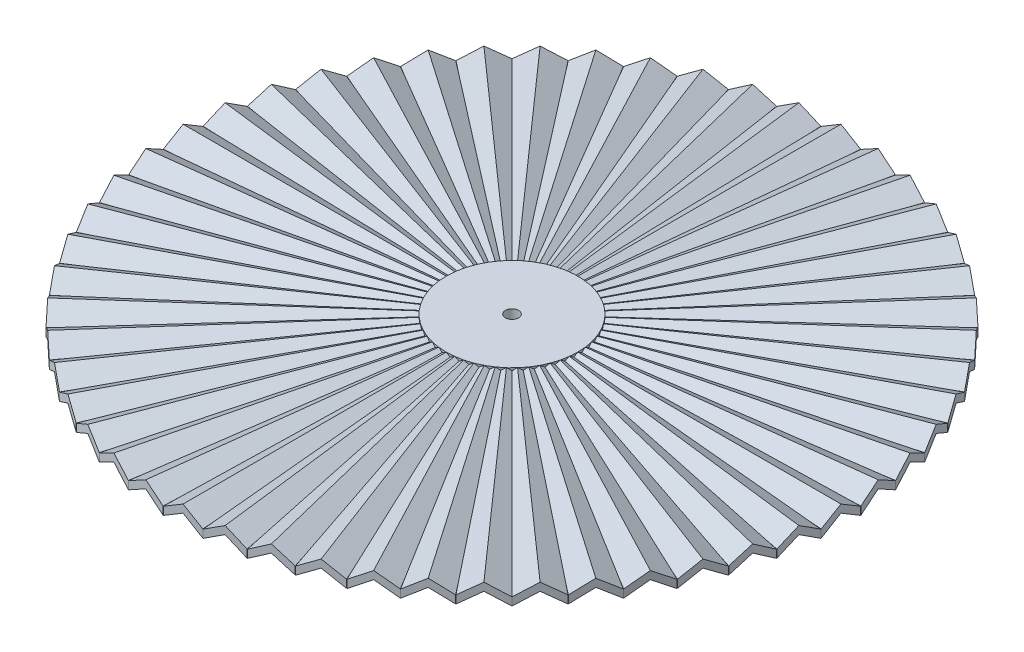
from build123d import *

# Parameters (mm, degrees)
SALIENTE_EXTRUIR1_DEPTH      = 200
CORTAR_EXTRUIR1_DEPTH        = 200
MATRIZC1_COUNT               = 52
SALIENTE_EXTRUIR2_DEPTH      = 6
SALIENTE_EXTRUIR2_DEPTH_BACK = 3
CROQUIS6_R                   = 50
CROQUIS7_R                   = 5
CORTAR_EXTRUIR2_DEPTH        = 40


with BuildPart() as part:
    # Croquis1 → Saliente-Extruir1 (new body)
    with BuildSketch(Plane.XY.offset(250)):
        Polygon((0, 6), (-15, -2.938354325), (-15, -9), (0, 0), (15, -9), (15, -2.938354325), align=None)
    extrude(amount=-SALIENTE_EXTRUIR1_DEPTH)

    # Croquis4 → Cortar-Extruir1 (cut)
    with BuildSketch(Plane(origin=(0, 6, 0), x_dir=(1, 0, 0), z_dir=(0, 1, 0))):
        Polygon((0, -50), (-5, -50), (-15, -249.549594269), (-28.729515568, -250), (-28.729515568, -15.319117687), (28.723249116, -15.319117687), (28.723249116, -250), (14.993733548, -249.549594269), (5, -50), align=None)
    extrude(amount=-CORTAR_EXTRUIR1_DEPTH, mode=Mode.SUBTRACT)


with BuildPart() as matrizc1_1:
    # MatrizC1: pattern copy
    add(part.part.rotate(Axis((0, 0, 0), (0, 1, 0)), 1 * 360 / MATRIZC1_COUNT))


with BuildPart() as matrizc1_2:
    # MatrizC1: pattern copy
    add(part.part.rotate(Axis((0, 0, 0), (0, 1, 0)), 2 * 360 / MATRIZC1_COUNT))


with BuildPart() as matrizc1_3:
    # MatrizC1: pattern copy
    add(part.part.rotate(Axis((0, 0, 0), (0, 1, 0)), 3 * 360 / MATRIZC1_COUNT))


with BuildPart() as matrizc1_4:
    # MatrizC1: pattern copy
    add(part.part.rotate(Axis((0, 0, 0), (0, 1, 0)), 4 * 360 / MATRIZC1_COUNT))


with BuildPart() as matrizc1_5:
    # MatrizC1: pattern copy
    add(part.part.rotate(Axis((0, 0, 0), (0, 1, 0)), 5 * 360 / MATRIZC1_COUNT))


with BuildPart() as matrizc1_6:
    # MatrizC1: pattern copy
    add(part.part.rotate(Axis((0, 0, 0), (0, 1, 0)), 6 * 360 / MATRIZC1_COUNT))


with BuildPart() as matrizc1_7:
    # MatrizC1: pattern copy
    add(part.part.rotate(Axis((0, 0, 0), (0, 1, 0)), 7 * 360 / MATRIZC1_COUNT))


with BuildPart() as matrizc1_8:
    # MatrizC1: pattern copy
    add(part.part.rotate(Axis((0, 0, 0), (0, 1, 0)), 8 * 360 / MATRIZC1_COUNT))


with BuildPart() as matrizc1_9:
    # MatrizC1: pattern copy
    add(part.part.rotate(Axis((0, 0, 0), (0, 1, 0)), 9 * 360 / MATRIZC1_COUNT))


with BuildPart() as matrizc1_10:
    # MatrizC1: pattern copy
    add(part.part.rotate(Axis((0, 0, 0), (0, 1, 0)), 10 * 360 / MATRIZC1_COUNT))


with BuildPart() as matrizc1_11:
    # MatrizC1: pattern copy
    add(part.part.rotate(Axis((0, 0, 0), (0, 1, 0)), 11 * 360 / MATRIZC1_COUNT))


with BuildPart() as matrizc1_12:
    # MatrizC1: pattern copy
    add(part.part.rotate(Axis((0, 0, 0), (0, 1, 0)), 12 * 360 / MATRIZC1_COUNT))


with BuildPart() as matrizc1_13:
    # MatrizC1: pattern copy
    add(part.part.rotate(Axis((0, 0, 0), (0, 1, 0)), 13 * 360 / MATRIZC1_COUNT))


with BuildPart() as matrizc1_14:
    # MatrizC1: pattern copy
    add(part.part.rotate(Axis((0, 0, 0), (0, 1, 0)), 14 * 360 / MATRIZC1_COUNT))


with BuildPart() as matrizc1_15:
    # MatrizC1: pattern copy
    add(part.part.rotate(Axis((0, 0, 0), (0, 1, 0)), 15 * 360 / MATRIZC1_COUNT))


with BuildPart() as matrizc1_16:
    # MatrizC1: pattern copy
    add(part.part.rotate(Axis((0, 0, 0), (0, 1, 0)), 16 * 360 / MATRIZC1_COUNT))


with BuildPart() as matrizc1_17:
    # MatrizC1: pattern copy
    add(part.part.rotate(Axis((0, 0, 0), (0, 1, 0)), 17 * 360 / MATRIZC1_COUNT))


with BuildPart() as matrizc1_18:
    # MatrizC1: pattern copy
    add(part.part.rotate(Axis((0, 0, 0), (0, 1, 0)), 18 * 360 / MATRIZC1_COUNT))


with BuildPart() as matrizc1_19:
    # MatrizC1: pattern copy
    add(part.part.rotate(Axis((0, 0, 0), (0, 1, 0)), 19 * 360 / MATRIZC1_COUNT))


with BuildPart() as matrizc1_20:
    # MatrizC1: pattern copy
    add(part.part.rotate(Axis((0, 0, 0), (0, 1, 0)), 20 * 360 / MATRIZC1_COUNT))


with BuildPart() as matrizc1_21:
    # MatrizC1: pattern copy
    add(part.part.rotate(Axis((0, 0, 0), (0, 1, 0)), 21 * 360 / MATRIZC1_COUNT))


with BuildPart() as matrizc1_22:
    # MatrizC1: pattern copy
    add(part.part.rotate(Axis((0, 0, 0), (0, 1, 0)), 22 * 360 / MATRIZC1_COUNT))


with BuildPart() as matrizc1_23:
    # MatrizC1: pattern copy
    add(part.part.rotate(Axis((0, 0, 0), (0, 1, 0)), 23 * 360 / MATRIZC1_COUNT))


with BuildPart() as matrizc1_24:
    # MatrizC1: pattern copy
    add(part.part.rotate(Axis((0, 0, 0), (0, 1, 0)), 24 * 360 / MATRIZC1_COUNT))


with BuildPart() as matrizc1_25:
    # MatrizC1: pattern copy
    add(part.part.rotate(Axis((0, 0, 0), (0, 1, 0)), 25 * 360 / MATRIZC1_COUNT))


with BuildPart() as matrizc1_26:
    # MatrizC1: pattern copy
    add(part.part.rotate(Axis((0, 0, 0), (0, 1, 0)), 26 * 360 / MATRIZC1_COUNT))


with BuildPart() as matrizc1_27:
    # MatrizC1: pattern copy
    add(part.part.rotate(Axis((0, 0, 0), (0, 1, 0)), 27 * 360 / MATRIZC1_COUNT))


with BuildPart() as matrizc1_28:
    # MatrizC1: pattern copy
    add(part.part.rotate(Axis((0, 0, 0), (0, 1, 0)), 28 * 360 / MATRIZC1_COUNT))


with BuildPart() as matrizc1_29:
    # MatrizC1: pattern copy
    add(part.part.rotate(Axis((0, 0, 0), (0, 1, 0)), 29 * 360 / MATRIZC1_COUNT))


with BuildPart() as matrizc1_30:
    # MatrizC1: pattern copy
    add(part.part.rotate(Axis((0, 0, 0), (0, 1, 0)), 30 * 360 / MATRIZC1_COUNT))


with BuildPart() as matrizc1_31:
    # MatrizC1: pattern copy
    add(part.part.rotate(Axis((0, 0, 0), (0, 1, 0)), 31 * 360 / MATRIZC1_COUNT))


with BuildPart() as matrizc1_32:
    # MatrizC1: pattern copy
    add(part.part.rotate(Axis((0, 0, 0), (0, 1, 0)), 32 * 360 / MATRIZC1_COUNT))


with BuildPart() as matrizc1_33:
    # MatrizC1: pattern copy
    add(part.part.rotate(Axis((0, 0, 0), (0, 1, 0)), 33 * 360 / MATRIZC1_COUNT))


with BuildPart() as matrizc1_34:
    # MatrizC1: pattern copy
    add(part.part.rotate(Axis((0, 0, 0), (0, 1, 0)), 34 * 360 / MATRIZC1_COUNT))


with BuildPart() as matrizc1_35:
    # MatrizC1: pattern copy
    add(part.part.rotate(Axis((0, 0, 0), (0, 1, 0)), 35 * 360 / MATRIZC1_COUNT))


with BuildPart() as matrizc1_36:
    # MatrizC1: pattern copy
    add(part.part.rotate(Axis((0, 0, 0), (0, 1, 0)), 36 * 360 / MATRIZC1_COUNT))


with BuildPart() as matrizc1_37:
    # MatrizC1: pattern copy
    add(part.part.rotate(Axis((0, 0, 0), (0, 1, 0)), 37 * 360 / MATRIZC1_COUNT))


with BuildPart() as matrizc1_38:
    # MatrizC1: pattern copy
    add(part.part.rotate(Axis((0, 0, 0), (0, 1, 0)), 38 * 360 / MATRIZC1_COUNT))


with BuildPart() as matrizc1_39:
    # MatrizC1: pattern copy
    add(part.part.rotate(Axis((0, 0, 0), (0, 1, 0)), 39 * 360 / MATRIZC1_COUNT))


with BuildPart() as matrizc1_40:
    # MatrizC1: pattern copy
    add(part.part.rotate(Axis((0, 0, 0), (0, 1, 0)), 40 * 360 / MATRIZC1_COUNT))


with BuildPart() as matrizc1_41:
    # MatrizC1: pattern copy
    add(part.part.rotate(Axis((0, 0, 0), (0, 1, 0)), 41 * 360 / MATRIZC1_COUNT))


with BuildPart() as matrizc1_42:
    # MatrizC1: pattern copy
    add(part.part.rotate(Axis((0, 0, 0), (0, 1, 0)), 42 * 360 / MATRIZC1_COUNT))


with BuildPart() as matrizc1_43:
    # MatrizC1: pattern copy
    add(part.part.rotate(Axis((0, 0, 0), (0, 1, 0)), 43 * 360 / MATRIZC1_COUNT))


with BuildPart() as matrizc1_44:
    # MatrizC1: pattern copy
    add(part.part.rotate(Axis((0, 0, 0), (0, 1, 0)), 44 * 360 / MATRIZC1_COUNT))


with BuildPart() as matrizc1_45:
    # MatrizC1: pattern copy
    add(part.part.rotate(Axis((0, 0, 0), (0, 1, 0)), 45 * 360 / MATRIZC1_COUNT))


with BuildPart() as matrizc1_46:
    # MatrizC1: pattern copy
    add(part.part.rotate(Axis((0, 0, 0), (0, 1, 0)), 46 * 360 / MATRIZC1_COUNT))


with BuildPart() as matrizc1_47:
    # MatrizC1: pattern copy
    add(part.part.rotate(Axis((0, 0, 0), (0, 1, 0)), 47 * 360 / MATRIZC1_COUNT))


with BuildPart() as matrizc1_48:
    # MatrizC1: pattern copy
    add(part.part.rotate(Axis((0, 0, 0), (0, 1, 0)), 48 * 360 / MATRIZC1_COUNT))


with BuildPart() as matrizc1_49:
    # MatrizC1: pattern copy
    add(part.part.rotate(Axis((0, 0, 0), (0, 1, 0)), 49 * 360 / MATRIZC1_COUNT))


with BuildPart() as matrizc1_50:
    # MatrizC1: pattern copy
    add(part.part.rotate(Axis((0, 0, 0), (0, 1, 0)), 50 * 360 / MATRIZC1_COUNT))


with BuildPart() as matrizc1_51:
    # MatrizC1: pattern copy
    add(part.part.rotate(Axis((0, 0, 0), (0, 1, 0)), 51 * 360 / MATRIZC1_COUNT))


with BuildPart() as part_1:
    add(part.part)

    add(matrizc1_1.part)  # Saliente-Extruir2 merges MatrizC1_1

    add(matrizc1_2.part)  # Saliente-Extruir2 merges MatrizC1_2

    add(matrizc1_3.part)  # Saliente-Extruir2 merges MatrizC1_3

    add(matrizc1_4.part)  # Saliente-Extruir2 merges MatrizC1_4

    add(matrizc1_5.part)  # Saliente-Extruir2 merges MatrizC1_5

    add(matrizc1_6.part)  # Saliente-Extruir2 merges MatrizC1_6

    add(matrizc1_7.part)  # Saliente-Extruir2 merges MatrizC1_7

    add(matrizc1_8.part)  # Saliente-Extruir2 merges MatrizC1_8

    add(matrizc1_9.part)  # Saliente-Extruir2 merges MatrizC1_9

    add(matrizc1_10.part)  # Saliente-Extruir2 merges MatrizC1_10

    add(matrizc1_11.part)  # Saliente-Extruir2 merges MatrizC1_11

    add(matrizc1_12.part)  # Saliente-Extruir2 merges MatrizC1_12

    add(matrizc1_13.part)  # Saliente-Extruir2 merges MatrizC1_13

    add(matrizc1_14.part)  # Saliente-Extruir2 merges MatrizC1_14

    add(matrizc1_15.part)  # Saliente-Extruir2 merges MatrizC1_15

    add(matrizc1_16.part)  # Saliente-Extruir2 merges MatrizC1_16

    add(matrizc1_17.part)  # Saliente-Extruir2 merges MatrizC1_17

    add(matrizc1_18.part)  # Saliente-Extruir2 merges MatrizC1_18

    add(matrizc1_19.part)  # Saliente-Extruir2 merges MatrizC1_19

    add(matrizc1_20.part)  # Saliente-Extruir2 merges MatrizC1_20

    add(matrizc1_21.part)  # Saliente-Extruir2 merges MatrizC1_21

    add(matrizc1_22.part)  # Saliente-Extruir2 merges MatrizC1_22

    add(matrizc1_23.part)  # Saliente-Extruir2 merges MatrizC1_23

    add(matrizc1_24.part)  # Saliente-Extruir2 merges MatrizC1_24

    add(matrizc1_25.part)  # Saliente-Extruir2 merges MatrizC1_25

    add(matrizc1_26.part)  # Saliente-Extruir2 merges MatrizC1_26

    add(matrizc1_27.part)  # Saliente-Extruir2 merges MatrizC1_27

    add(matrizc1_28.part)  # Saliente-Extruir2 merges MatrizC1_28

    add(matrizc1_29.part)  # Saliente-Extruir2 merges MatrizC1_29

    add(matrizc1_30.part)  # Saliente-Extruir2 merges MatrizC1_30

    add(matrizc1_31.part)  # Saliente-Extruir2 merges MatrizC1_31

    add(matrizc1_32.part)  # Saliente-Extruir2 merges MatrizC1_32

    add(matrizc1_33.part)  # Saliente-Extruir2 merges MatrizC1_33

    add(matrizc1_34.part)  # Saliente-Extruir2 merges MatrizC1_34

    add(matrizc1_35.part)  # Saliente-Extruir2 merges MatrizC1_35

    add(matrizc1_36.part)  # Saliente-Extruir2 merges MatrizC1_36

    add(matrizc1_37.part)  # Saliente-Extruir2 merges MatrizC1_37

    add(matrizc1_38.part)  # Saliente-Extruir2 merges MatrizC1_38

    add(matrizc1_39.part)  # Saliente-Extruir2 merges MatrizC1_39

    add(matrizc1_40.part)  # Saliente-Extruir2 merges MatrizC1_40

    add(matrizc1_41.part)  # Saliente-Extruir2 merges MatrizC1_41

    add(matrizc1_42.part)  # Saliente-Extruir2 merges MatrizC1_42

    add(matrizc1_43.part)  # Saliente-Extruir2 merges MatrizC1_43

    add(matrizc1_44.part)  # Saliente-Extruir2 merges MatrizC1_44

    add(matrizc1_45.part)  # Saliente-Extruir2 merges MatrizC1_45

    add(matrizc1_46.part)  # Saliente-Extruir2 merges MatrizC1_46

    add(matrizc1_47.part)  # Saliente-Extruir2 merges MatrizC1_47

    add(matrizc1_48.part)  # Saliente-Extruir2 merges MatrizC1_48

    add(matrizc1_49.part)  # Saliente-Extruir2 merges MatrizC1_49

    add(matrizc1_50.part)  # Saliente-Extruir2 merges MatrizC1_50

    add(matrizc1_51.part)  # Saliente-Extruir2 merges MatrizC1_51
    # Croquis6 → Saliente-Extruir2 (add, two sides: drawn at the far end of the back side and taken through both)
    with BuildSketch(Plane(origin=(0, 0, 0), x_dir=(1, 0, 0), z_dir=(0, 1, 0)).offset(-SALIENTE_EXTRUIR2_DEPTH_BACK)):
        with Locations(Location((0, 0, 0), (0, 0, 270))):
            Circle(CROQUIS6_R)
    extrude(amount=SALIENTE_EXTRUIR2_DEPTH + SALIENTE_EXTRUIR2_DEPTH_BACK)

    # Croquis7 → Cortar-Extruir2 (cut, symmetric)
    with BuildSketch(Plane(origin=(0, 0, 0), x_dir=(1, 0, 0), z_dir=(0, 1, 0))):
        with Locations(Location((0, 0, 0), (0, 0, 270))):
            Circle(CROQUIS7_R)
    extrude(amount=CORTAR_EXTRUIR2_DEPTH, both=True, mode=Mode.SUBTRACT)


solid = part_1.part
